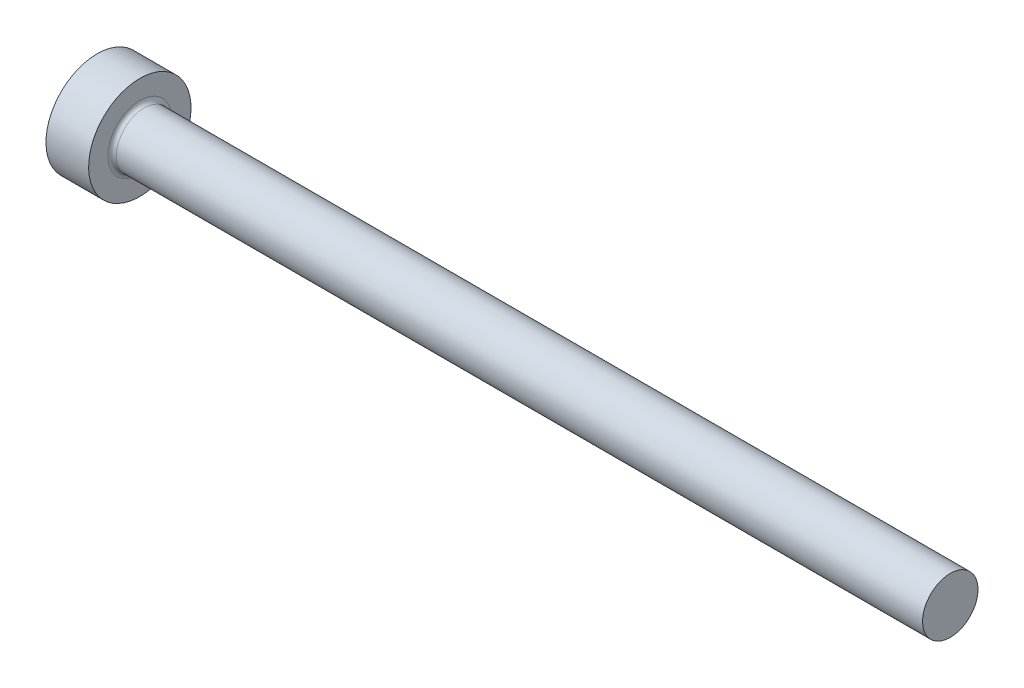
ISO-10303-21;
HEADER;
FILE_DESCRIPTION(('STEP AP214'),'2;1');
FILE_NAME('part.step','',(''),(''),'','','');
FILE_SCHEMA(('AUTOMOTIVE_DESIGN { 1 0 10303 214 1 1 1 1 }'));
ENDSEC;
DATA;
#1=APPLICATION_CONTEXT('core data for automotive mechanical design processes');
#2=APPLICATION_PROTOCOL_DEFINITION('international standard','automotive_design',2000,#1);
#3=PRODUCT_CONTEXT('',#1,'mechanical');
#4=PRODUCT('Part','Part','',(#3));
#5=PRODUCT_RELATED_PRODUCT_CATEGORY('part','',(#4));
#6=PRODUCT_DEFINITION_FORMATION('','',#4);
#7=PRODUCT_DEFINITION_CONTEXT('part definition',#1,'design');
#8=PRODUCT_DEFINITION('design','',#6,#7);
#9=PRODUCT_DEFINITION_SHAPE('','',#8);
#10=(LENGTH_UNIT() NAMED_UNIT(*) SI_UNIT(.MILLI.,.METRE.));
#11=(NAMED_UNIT(*) PLANE_ANGLE_UNIT() SI_UNIT($,.RADIAN.));
#12=(NAMED_UNIT(*) SI_UNIT($,.STERADIAN.) SOLID_ANGLE_UNIT());
#13=UNCERTAINTY_MEASURE_WITH_UNIT(LENGTH_MEASURE(1.E-05),#10,'distance_accuracy_value','');
#14=(GEOMETRIC_REPRESENTATION_CONTEXT(3) GLOBAL_UNCERTAINTY_ASSIGNED_CONTEXT((#13)) GLOBAL_UNIT_ASSIGNED_CONTEXT((#10,
#11,#12)) REPRESENTATION_CONTEXT('',''));
#15=CARTESIAN_POINT('',(0.,0.,0.));
#16=DIRECTION('',(0.,0.,1.));
#17=DIRECTION('',(1.,0.,0.));
#18=AXIS2_PLACEMENT_3D('',#15,#16,#17);
#19=CARTESIAN_POINT('',(0.,0.,0.));
#20=DIRECTION('',(-1.,0.,0.));
#21=DIRECTION('',(0.,-1.,0.));
#22=AXIS2_PLACEMENT_3D('',#19,#20,#21);
#23=PLANE('',#22);
#24=CARTESIAN_POINT('',(0.,0.,0.));
#25=DIRECTION('',(1.,0.,0.));
#26=DIRECTION('',(0.,1.,0.));
#27=AXIS2_PLACEMENT_3D('',#24,#25,#26);
#28=CIRCLE('',#27,6.);
#29=CARTESIAN_POINT('',(0.,6.,0.));
#30=VERTEX_POINT('',#29);
#31=EDGE_CURVE('E25',#30,#30,#28,.T.);
#32=ORIENTED_EDGE('',*,*,#31,.F.);
#33=EDGE_LOOP('',(#32));
#34=FACE_BOUND('',#33,.T.);
#35=ADVANCED_FACE('F14',(#34),#23,.T.);
#36=CARTESIAN_POINT('',(100.,0.,0.));
#37=DIRECTION('',(1.,0.,0.));
#38=DIRECTION('',(0.,1.,0.));
#39=AXIS2_PLACEMENT_3D('',#36,#37,#38);
#40=CYLINDRICAL_SURFACE('',#39,6.);
#41=ORIENTED_EDGE('',*,*,#31,.T.);
#42=EDGE_LOOP('',(#41));
#43=FACE_BOUND('',#42,.T.);
#44=CARTESIAN_POINT('',(5.,0.,0.));
#45=DIRECTION('',(1.,0.,0.));
#46=DIRECTION('',(0.,1.,0.));
#47=AXIS2_PLACEMENT_3D('',#44,#45,#46);
#48=CIRCLE('',#47,6.);
#49=CARTESIAN_POINT('',(5.,6.,0.));
#50=VERTEX_POINT('',#49);
#51=EDGE_CURVE('E29',#50,#50,#48,.T.);
#52=ORIENTED_EDGE('',*,*,#51,.F.);
#53=EDGE_LOOP('',(#52));
#54=FACE_BOUND('',#53,.T.);
#55=ADVANCED_FACE('F51',(#43,#54),#40,.T.);
#56=CARTESIAN_POINT('',(5.,6.,0.));
#57=DIRECTION('',(1.,0.,0.));
#58=DIRECTION('',(0.,1.,0.));
#59=AXIS2_PLACEMENT_3D('',#56,#57,#58);
#60=PLANE('',#59);
#61=CARTESIAN_POINT('',(5.,0.,0.));
#62=DIRECTION('',(1.,0.,0.));
#63=DIRECTION('',(0.,1.,0.));
#64=AXIS2_PLACEMENT_3D('',#61,#62,#63);
#65=CIRCLE('',#64,3.74999999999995);
#66=CARTESIAN_POINT('',(5.,3.74999999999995,0.));
#67=VERTEX_POINT('',#66);
#68=EDGE_CURVE('E9',#67,#67,#65,.F.);
#69=ORIENTED_EDGE('',*,*,#68,.T.);
#70=EDGE_LOOP('',(#69));
#71=FACE_BOUND('',#70,.T.);
#72=ORIENTED_EDGE('',*,*,#51,.T.);
#73=EDGE_LOOP('',(#72));
#74=FACE_BOUND('',#73,.T.);
#75=ADVANCED_FACE('F42',(#71,#74),#60,.T.);
#76=CARTESIAN_POINT('',(100.,0.,0.));
#77=DIRECTION('',(1.,0.,0.));
#78=DIRECTION('',(0.,1.,0.));
#79=AXIS2_PLACEMENT_3D('',#76,#77,#78);
#80=CYLINDRICAL_SURFACE('',#79,3.24999999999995);
#81=CARTESIAN_POINT('',(5.5,0.,0.));
#82=DIRECTION('',(1.,0.,0.));
#83=DIRECTION('',(0.,1.,0.));
#84=AXIS2_PLACEMENT_3D('',#81,#82,#83);
#85=CIRCLE('',#84,3.24999999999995);
#86=CARTESIAN_POINT('',(5.5,3.24999999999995,0.));
#87=VERTEX_POINT('',#86);
#88=EDGE_CURVE('E21',#87,#87,#85,.T.);
#89=ORIENTED_EDGE('',*,*,#88,.T.);
#90=EDGE_LOOP('',(#89));
#91=FACE_BOUND('',#90,.T.);
#92=CARTESIAN_POINT('',(100.,0.,0.));
#93=DIRECTION('',(1.,0.,0.));
#94=DIRECTION('',(0.,1.,0.));
#95=AXIS2_PLACEMENT_3D('',#92,#93,#94);
#96=CIRCLE('',#95,3.25);
#97=CARTESIAN_POINT('',(100.,3.24999999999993,0.));
#98=VERTEX_POINT('',#97);
#99=EDGE_CURVE('E34',#98,#98,#96,.T.);
#100=ORIENTED_EDGE('',*,*,#99,.F.);
#101=EDGE_LOOP('',(#100));
#102=FACE_BOUND('',#101,.T.);
#103=ADVANCED_FACE('F40',(#91,#102),#80,.T.);
#104=CARTESIAN_POINT('',(100.,3.24999999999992,0.));
#105=DIRECTION('',(1.,0.,0.));
#106=DIRECTION('',(0.,1.,0.));
#107=AXIS2_PLACEMENT_3D('',#104,#105,#106);
#108=PLANE('',#107);
#109=ORIENTED_EDGE('',*,*,#99,.T.);
#110=EDGE_LOOP('',(#109));
#111=FACE_BOUND('',#110,.T.);
#112=ADVANCED_FACE('F38',(#111),#108,.T.);
#113=CARTESIAN_POINT('',(5.5,0.,0.));
#114=DIRECTION('',(1.,0.,0.));
#115=DIRECTION('',(0.,1.,0.));
#116=AXIS2_PLACEMENT_3D('',#113,#114,#115);
#117=TOROIDAL_SURFACE('',#116,3.74999999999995,0.5);
#118=ORIENTED_EDGE('',*,*,#68,.F.);
#119=EDGE_LOOP('',(#118));
#120=FACE_BOUND('',#119,.T.);
#121=ORIENTED_EDGE('',*,*,#88,.F.);
#122=EDGE_LOOP('',(#121));
#123=FACE_BOUND('',#122,.T.);
#124=ADVANCED_FACE('F16',(#120,#123),#117,.F.);
#125=CLOSED_SHELL('',(#35,#55,#75,#103,#112,#124));
#126=MANIFOLD_SOLID_BREP('B1',#125);
#127=ADVANCED_BREP_SHAPE_REPRESENTATION('',(#18,#126),#14);
#128=SHAPE_DEFINITION_REPRESENTATION(#9,#127);
ENDSEC;
END-ISO-10303-21;
